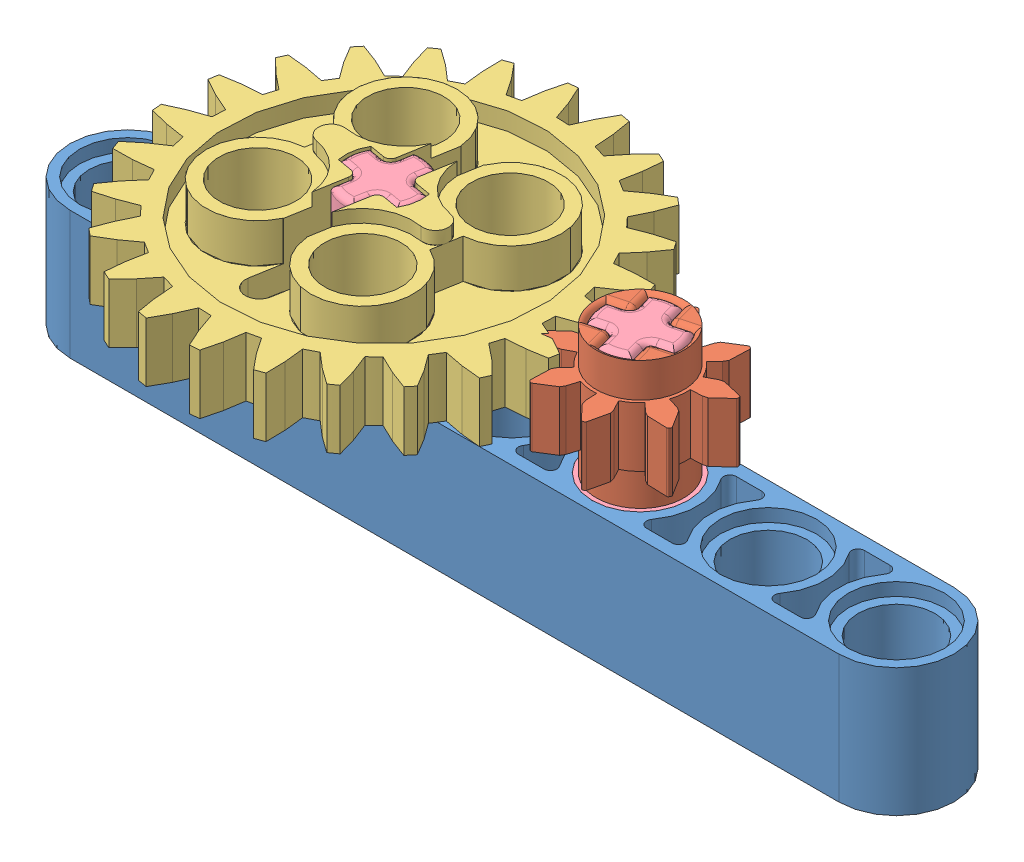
SolidWorks assembly 11.1.SLDASM, configuration Default (file format 12000). Lengths in mm.
Overall size (55.2 16 30.17).
5 component instances, 4 part files, 11 mates.
Components (placement in the parent):
- 32524 Beam 7-1: 32524 Beam 7.SLDPRT [Default] at (1.9447 31.0889 50.6666) size (55.2 8 7.2)
- 3647 Gear 8-1: 3647 Gear 8.SLDPRT [Default] at (33.9447 43.0889 50.6666) x (-0.965452 0 0.260582) z (-0.260582 0 -0.965452) size (10.06 8 10.06)
- 3648 Gear 24-1: 3648 Gear 24.SLDPRT [Default] at (17.9447 43.0889 50.6666) x (0.170461 0 -0.985364) z (0.985364 0 0.170461) size (26.1 8 26.1)
- 3749 Axle Pin without Friction Ridges Lengthwise-1: 3749 Axle Pin without Friction Ridges Lengthwise.SLDPRT [Default] at (33.9447 39.0889 50.6666) x (0.965452 0 -0.260582) z (0.260582 0 0.965452) size (6 16 6)
- 3749 Axle Pin without Friction Ridges Lengthwise-2: 3749 Axle Pin without Friction Ridges Lengthwise.SLDPRT [Default] at (17.9447 39.0889 50.6666) x (0.985364 0 0.170461) z (-0.170461 0 0.985364) size (6 16 6)
Mates (geometry in assembly coordinates):
- Concentric1: concentric anti-aligned: cylinder of 32524 Beam 7-1 through (33.9447 39.0889 50.6666) axis (0 -1 0) radius 2.4; cylinder of 3749 Axle Pin without Friction Ridges Lengthwise-1 through (33.9447 31.0889 50.6666) axis (0 1 0) radius 2.4
- Concentric2: concentric anti-aligned: cylinder of 32524 Beam 7-1 through (17.9447 39.0889 50.6666) axis (0 -1 0) radius 2.4; cylinder of 3749 Axle Pin without Friction Ridges Lengthwise-2 through (17.9447 31.0889 50.6666) axis (0 1 0) radius 2.4
- Concentric3: concentric anti-aligned: cylinder of 3648 Gear 24-1 through (17.9447 39.0889 50.6666) axis (0 1 0) radius 2.4; cylinder of 3749 Axle Pin without Friction Ridges Lengthwise-2 through (17.9447 47.0889 50.6666) axis (0 -1 0) radius 2.4
- Coincident1: coincident anti-aligned: plane of 3648 Gear 24-1 through (16.5334 39.0889 51.3156) normal (0.170461 0 -0.985364); plane of 3749 Axle Pin without Friction Ridges Lengthwise-2 through (19.0559 47.0889 51.7519) normal (-0.170461 0 0.985364)
- Coincident2: coincident anti-aligned: plane of 32524 Beam 7-1 through (1.9447 39.0889 50.6666) normal (0 1 0); plane of 3648 Gear 24-1 through (14.0152 39.0889 50.0245) normal (0 -1 0)
- Concentric4: concentric anti-aligned: cylinder of 3647 Gear 8-1 through (33.9447 39.0889 50.6666) axis (0 1 0) radius 2.4; cylinder of 3749 Axle Pin without Friction Ridges Lengthwise-1 through (33.9447 47.0889 50.6666) axis (0 -1 0) radius 2.4
- Coincident3: coincident anti-aligned: plane of 32524 Beam 7-1 through (33.9447 38.2889 50.6666) normal (0 1 0); plane of 3749 Axle Pin without Friction Ridges Lengthwise-1 through (33.9447 38.2889 50.6666) normal (0 -1 0)
- Coincident4: coincident anti-aligned: plane of 32524 Beam 7-1 through (1.9447 39.0889 50.6666) normal (0 1 0); plane of 3647 Gear 8-1 through (33.9447 39.0889 50.6666) normal (0 -1 0)
- Coincident5: coincident anti-aligned: plane of 32524 Beam 7-1 through (17.9447 38.2889 50.6666) normal (0 1 0); plane of 3749 Axle Pin without Friction Ridges Lengthwise-2 through (17.9447 38.2889 50.6666) normal (0 -1 0)
- GearMate1: gear = 5.865 mm: circle of 3648 Gear 24-1; circle of 3647 Gear 8-1
- Coincident6: coincident anti-aligned: plane of 3647 Gear 8-1 through (32.0183 39.0889 52.0981) normal (-0.260582 0 -0.965452); plane of 3749 Axle Pin without Friction Ridges Lengthwise-1 through (32.0183 47.0889 52.0981) normal (0.260582 0 0.965452)
